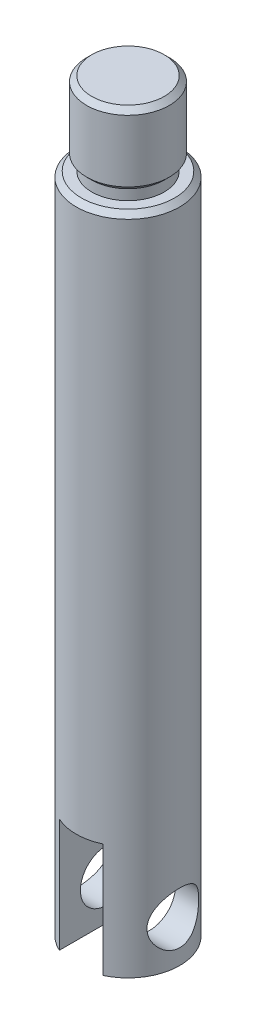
ISO-10303-21;
HEADER;
FILE_DESCRIPTION(('STEP AP214'),'2;1');
FILE_NAME('part.step','',(''),(''),'','','');
FILE_SCHEMA(('AUTOMOTIVE_DESIGN { 1 0 10303 214 1 1 1 1 }'));
ENDSEC;
DATA;
#1=APPLICATION_CONTEXT('core data for automotive mechanical design processes');
#2=APPLICATION_PROTOCOL_DEFINITION('international standard','automotive_design',2000,#1);
#3=PRODUCT_CONTEXT('',#1,'mechanical');
#4=PRODUCT('Part','Part','',(#3));
#5=PRODUCT_RELATED_PRODUCT_CATEGORY('part','',(#4));
#6=PRODUCT_DEFINITION_FORMATION('','',#4);
#7=PRODUCT_DEFINITION_CONTEXT('part definition',#1,'design');
#8=PRODUCT_DEFINITION('design','',#6,#7);
#9=PRODUCT_DEFINITION_SHAPE('','',#8);
#10=(LENGTH_UNIT() NAMED_UNIT(*) SI_UNIT(.MILLI.,.METRE.));
#11=(NAMED_UNIT(*) PLANE_ANGLE_UNIT() SI_UNIT($,.RADIAN.));
#12=(NAMED_UNIT(*) SI_UNIT($,.STERADIAN.) SOLID_ANGLE_UNIT());
#13=UNCERTAINTY_MEASURE_WITH_UNIT(LENGTH_MEASURE(1.E-05),#10,'distance_accuracy_value','');
#14=(GEOMETRIC_REPRESENTATION_CONTEXT(3) GLOBAL_UNCERTAINTY_ASSIGNED_CONTEXT((#13)) GLOBAL_UNIT_ASSIGNED_CONTEXT((#10,
#11,#12)) REPRESENTATION_CONTEXT('',''));
#15=CARTESIAN_POINT('',(0.,0.,0.));
#16=DIRECTION('',(0.,0.,1.));
#17=DIRECTION('',(1.,0.,0.));
#18=AXIS2_PLACEMENT_3D('',#15,#16,#17);
#19=CARTESIAN_POINT('',(0.,-32.5,0.));
#20=DIRECTION('',(0.,-1.,0.));
#21=DIRECTION('',(0.,0.,-1.));
#22=AXIS2_PLACEMENT_3D('',#19,#20,#21);
#23=PLANE('',#22);
#24=DIRECTION('',(0.,0.,-1.));
#25=VECTOR('',#24,1.);
#26=CARTESIAN_POINT('',(-1.05,-32.5,-2.5979873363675));
#27=LINE('',#26,#25);
#28=CARTESIAN_POINT('',(-1.05,-32.5,2.26881026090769));
#29=VERTEX_POINT('',#28);
#30=CARTESIAN_POINT('',(-1.05,-32.5,-2.26881026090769));
#31=VERTEX_POINT('',#30);
#32=EDGE_CURVE('E84',#29,#31,#27,.T.);
#33=ORIENTED_EDGE('',*,*,#32,.F.);
#34=CARTESIAN_POINT('',(0.,-32.5,0.));
#35=DIRECTION('',(0.,-1.,0.));
#36=DIRECTION('',(0.,0.,-1.));
#37=AXIS2_PLACEMENT_3D('',#34,#35,#36);
#38=CIRCLE('',#37,2.5);
#39=EDGE_CURVE('E97',#29,#31,#38,.T.);
#40=ORIENTED_EDGE('',*,*,#39,.T.);
#41=EDGE_LOOP('',(#33,#40));
#42=FACE_BOUND('',#41,.T.);
#43=ADVANCED_FACE('F35',(#42),#23,.T.);
#44=CARTESIAN_POINT('',(-4.25,-30.5,0.));
#45=DIRECTION('',(1.,0.,0.));
#46=DIRECTION('',(0.,0.,-1.));
#47=AXIS2_PLACEMENT_3D('',#44,#45,#46);
#48=CYLINDRICAL_SURFACE('',#47,1.25);
#49=CARTESIAN_POINT('',(-1.05,-30.5,0.));
#50=DIRECTION('',(-1.,0.,0.));
#51=DIRECTION('',(0.,0.,1.));
#52=AXIS2_PLACEMENT_3D('',#49,#50,#51);
#53=CIRCLE('',#52,1.25);
#54=CARTESIAN_POINT('',(-1.05,-30.5,1.25));
#55=VERTEX_POINT('',#54);
#56=EDGE_CURVE('E170',#55,#55,#53,.F.);
#57=ORIENTED_EDGE('',*,*,#56,.T.);
#58=EDGE_LOOP('',(#57));
#59=FACE_BOUND('',#58,.T.);
#60=CARTESIAN_POINT('',(-2.1650635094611,-30.5,-1.25));
#61=CARTESIAN_POINT('',(-2.16506918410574,-30.4348652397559,-1.24999545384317));
#62=CARTESIAN_POINT('',(-2.16804751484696,-30.3696482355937,-1.24487496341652));
#63=CARTESIAN_POINT('',(-2.17952958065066,-30.2412159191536,-1.22465401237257));
#64=CARTESIAN_POINT('',(-2.18804492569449,-30.1780051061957,-1.20953258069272));
#65=CARTESIAN_POINT('',(-2.20936683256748,-30.0556854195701,-1.17012493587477));
#66=CARTESIAN_POINT('',(-2.22215054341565,-29.996556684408,-1.14588744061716));
#67=CARTESIAN_POINT('',(-2.25053331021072,-29.8832197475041,-1.08908440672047));
#68=CARTESIAN_POINT('',(-2.26613251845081,-29.8290118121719,-1.05651841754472));
#69=CARTESIAN_POINT('',(-2.29996086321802,-29.7221178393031,-0.980833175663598));
#70=CARTESIAN_POINT('',(-2.31830079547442,-29.6699260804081,-0.937065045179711));
#71=CARTESIAN_POINT('',(-2.35464978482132,-29.5732395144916,-0.841567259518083));
#72=CARTESIAN_POINT('',(-2.37265867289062,-29.5287485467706,-0.789833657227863));
#73=CARTESIAN_POINT('',(-2.40776846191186,-29.4457910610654,-0.67561195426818));
#74=CARTESIAN_POINT('',(-2.42472633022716,-29.4079327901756,-0.612633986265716));
#75=CARTESIAN_POINT('',(-2.45438445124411,-29.3435739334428,-0.480196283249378));
#76=CARTESIAN_POINT('',(-2.46708738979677,-29.3170661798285,-0.410740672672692));
#77=CARTESIAN_POINT('',(-2.48600576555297,-29.2781191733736,-0.27255617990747));
#78=CARTESIAN_POINT('',(-2.49261850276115,-29.2648130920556,-0.20412723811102));
#79=CARTESIAN_POINT('',(-2.50009479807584,-29.2497923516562,-0.0657132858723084));
#80=CARTESIAN_POINT('',(-2.50096183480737,-29.2480706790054,0.00427075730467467));
#81=CARTESIAN_POINT('',(-2.49703727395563,-29.2559333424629,0.137290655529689));
#82=CARTESIAN_POINT('',(-2.492731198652,-29.2645475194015,0.200401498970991));
#83=CARTESIAN_POINT('',(-2.47967806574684,-29.2911010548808,0.324142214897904));
#84=CARTESIAN_POINT('',(-2.47093067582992,-29.3090411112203,0.384771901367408));
#85=CARTESIAN_POINT('',(-2.44964479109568,-29.3538532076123,0.502886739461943));
#86=CARTESIAN_POINT('',(-2.43705551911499,-29.3808453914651,0.560316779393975));
#87=CARTESIAN_POINT('',(-2.40922057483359,-29.4428292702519,0.669971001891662));
#88=CARTESIAN_POINT('',(-2.39397395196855,-29.4778238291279,0.722193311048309));
#89=CARTESIAN_POINT('',(-2.36055492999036,-29.5586191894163,0.825217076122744));
#90=CARTESIAN_POINT('',(-2.34224219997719,-29.6051287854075,0.8754175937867));
#91=CARTESIAN_POINT('',(-2.30567925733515,-29.7057371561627,0.967630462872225));
#92=CARTESIAN_POINT('',(-2.28742910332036,-29.7598417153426,1.00963651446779));
#93=CARTESIAN_POINT('',(-2.25180195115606,-29.8783102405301,1.08688166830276));
#94=CARTESIAN_POINT('',(-2.23455399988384,-29.9431075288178,1.12152164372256));
#95=CARTESIAN_POINT('',(-2.2046931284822,-30.0786720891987,1.17914889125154));
#96=CARTESIAN_POINT('',(-2.19207537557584,-30.149433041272,1.20214832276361));
#97=CARTESIAN_POINT('',(-2.17430794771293,-30.2890181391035,1.2339752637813));
#98=CARTESIAN_POINT('',(-2.1686456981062,-30.3575513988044,1.24378140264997));
#99=CARTESIAN_POINT('',(-2.16397399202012,-30.4955016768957,1.25189618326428));
#100=CARTESIAN_POINT('',(-2.16495983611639,-30.5649180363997,1.25021294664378));
#101=CARTESIAN_POINT('',(-2.17292920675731,-30.6945673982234,1.23629505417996));
#102=CARTESIAN_POINT('',(-2.17924484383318,-30.7549743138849,1.22523477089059));
#103=CARTESIAN_POINT('',(-2.19617526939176,-30.8729597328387,1.19462035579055));
#104=CARTESIAN_POINT('',(-2.20679145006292,-30.9305373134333,1.17506347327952));
#105=CARTESIAN_POINT('',(-2.23170277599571,-31.0442641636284,1.12705948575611));
#106=CARTESIAN_POINT('',(-2.24614554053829,-31.1002237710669,1.09824257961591));
#107=CARTESIAN_POINT('',(-2.27695149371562,-31.2068365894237,1.03285883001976));
#108=CARTESIAN_POINT('',(-2.29331566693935,-31.2574870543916,0.99628800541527));
#109=CARTESIAN_POINT('',(-2.3285999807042,-31.3587234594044,0.911046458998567));
#110=CARTESIAN_POINT('',(-2.34758228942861,-31.4084964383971,0.861431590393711));
#111=CARTESIAN_POINT('',(-2.38417793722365,-31.499265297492,0.754255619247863));
#112=CARTESIAN_POINT('',(-2.40179081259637,-31.5402582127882,0.696691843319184));
#113=CARTESIAN_POINT('',(-2.43426702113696,-31.6132171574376,0.573169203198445));
#114=CARTESIAN_POINT('',(-2.44904552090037,-31.6449163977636,0.507028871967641));
#115=CARTESIAN_POINT('',(-2.47354193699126,-31.6964223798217,0.369402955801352));
#116=CARTESIAN_POINT('',(-2.48326429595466,-31.7162395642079,0.297922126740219));
#117=CARTESIAN_POINT('',(-2.49584385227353,-31.7417107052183,0.15872460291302));
#118=CARTESIAN_POINT('',(-2.49924909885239,-31.7484973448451,0.0912643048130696));
#119=CARTESIAN_POINT('',(-2.50052662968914,-31.751054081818,-0.0439074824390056));
#120=CARTESIAN_POINT('',(-2.49840085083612,-31.7468280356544,-0.111618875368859));
#121=CARTESIAN_POINT('',(-2.48917461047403,-31.7282294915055,-0.240672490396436));
#122=CARTESIAN_POINT('',(-2.48241118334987,-31.7145439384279,-0.302140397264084));
#123=CARTESIAN_POINT('',(-2.46490117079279,-31.6783412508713,-0.421807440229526));
#124=CARTESIAN_POINT('',(-2.45415401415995,-31.6558228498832,-0.480006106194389));
#125=CARTESIAN_POINT('',(-2.4290741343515,-31.6015911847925,-0.594279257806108));
#126=CARTESIAN_POINT('',(-2.41460771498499,-31.5695258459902,-0.65015642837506));
#127=CARTESIAN_POINT('',(-2.38360166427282,-31.4975525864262,-0.755968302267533));
#128=CARTESIAN_POINT('',(-2.36706108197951,-31.4576410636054,-0.805900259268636));
#129=CARTESIAN_POINT('',(-2.33160762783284,-31.3665035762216,-0.903642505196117));
#130=CARTESIAN_POINT('',(-2.31262248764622,-31.3145468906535,-0.950747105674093));
#131=CARTESIAN_POINT('',(-2.27578845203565,-31.2031865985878,-1.03582910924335));
#132=CARTESIAN_POINT('',(-2.25794057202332,-31.1437764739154,-1.07379843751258));
#133=CARTESIAN_POINT('',(-2.22499506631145,-31.0167041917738,-1.14053884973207));
#134=CARTESIAN_POINT('',(-2.21000217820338,-30.9488405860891,-1.16898133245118));
#135=CARTESIAN_POINT('',(-2.18582695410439,-30.8083344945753,-1.21359838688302));
#136=CARTESIAN_POINT('',(-2.17662520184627,-30.7357088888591,-1.22981398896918));
#137=CARTESIAN_POINT('',(-2.16911590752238,-30.635243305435,-1.24295875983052));
#138=CARTESIAN_POINT('',(-2.1676016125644,-30.6082901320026,-1.24559513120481));
#139=CARTESIAN_POINT('',(-2.16557419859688,-30.5542293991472,-1.24911675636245));
#140=CARTESIAN_POINT('',(-2.16506114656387,-30.5271218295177,-1.25000189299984));
#141=CARTESIAN_POINT('',(-2.1650635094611,-30.5,-1.25));
#142=B_SPLINE_CURVE_WITH_KNOTS('',3,(#60,#61,#62,#63,#64,#65,#66,#67,#68,#69,#70,#71,#72,#73,
#74,#75,#76,#77,#78,#79,#80,#81,#82,#83,#84,#85,#86,#87,#88,#89,#90,#91,#92,#93,#94,#95,#96,#97,
#98,#99,#100,#101,#102,#103,#104,#105,#106,#107,#108,#109,#110,#111,#112,#113,#114,#115,#116,
#117,#118,#119,#120,#121,#122,#123,#124,#125,#126,#127,#128,#129,#130,#131,#132,#133,#134,#135,
#136,#137,#138,#139,#140,#141),.UNSPECIFIED.,.T.,.F.,(4,2,2,2,2,2,2,2,2,2,2,2,2,2,2,2,2,2,2,2,2,
2,2,2,2,2,2,2,2,2,2,2,2,2,2,2,2,2,2,2,4),(0.,0.195290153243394,0.390991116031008,
0.585660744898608,0.780340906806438,0.991077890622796,1.20191963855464,1.42697365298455,
1.65188533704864,1.86079356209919,2.0695752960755,2.26020121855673,2.45084140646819,
2.64411918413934,2.8374662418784,3.04908989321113,3.26087560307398,3.4861105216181,
3.71110967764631,3.91827863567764,4.12530116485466,4.30967729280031,4.49411315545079,
4.6870912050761,4.88016857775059,5.09758429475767,5.31507331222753,5.53830226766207,
5.76133474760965,5.96390337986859,6.16640108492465,6.35555531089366,6.54473666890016,
6.7420093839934,6.93937287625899,7.15637802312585,7.37357428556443,7.59763436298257,
7.82093916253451,7.90225168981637,7.98356965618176),.UNSPECIFIED.);
#143=CARTESIAN_POINT('',(-2.1650635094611,-30.5,-1.25));
#144=VERTEX_POINT('',#143);
#145=EDGE_CURVE('E103',#144,#144,#142,.T.);
#146=ORIENTED_EDGE('',*,*,#145,.F.);
#147=EDGE_LOOP('',(#146));
#148=FACE_BOUND('',#147,.T.);
#149=ADVANCED_FACE('F147',(#59,#148),#48,.F.);
#150=CARTESIAN_POINT('',(0.,3.5,0.));
#151=DIRECTION('',(0.,-1.,0.));
#152=DIRECTION('',(0.,0.,-1.));
#153=AXIS2_PLACEMENT_3D('',#150,#151,#152);
#154=CYLINDRICAL_SURFACE('',#153,2.);
#155=CARTESIAN_POINT('',(0.,0.25,0.));
#156=DIRECTION('',(0.,1.,0.));
#157=DIRECTION('',(0.,0.,1.));
#158=AXIS2_PLACEMENT_3D('',#155,#156,#157);
#159=CIRCLE('',#158,2.);
#160=CARTESIAN_POINT('',(0.,0.25,2.));
#161=VERTEX_POINT('',#160);
#162=EDGE_CURVE('E110',#161,#161,#159,.T.);
#163=ORIENTED_EDGE('',*,*,#162,.T.);
#164=EDGE_LOOP('',(#163));
#165=FACE_BOUND('',#164,.T.);
#166=CARTESIAN_POINT('',(0.,3.25,0.));
#167=DIRECTION('',(0.,1.,0.));
#168=DIRECTION('',(0.,0.,1.));
#169=AXIS2_PLACEMENT_3D('',#166,#167,#168);
#170=CIRCLE('',#169,2.);
#171=CARTESIAN_POINT('',(0.,3.25,2.));
#172=VERTEX_POINT('',#171);
#173=EDGE_CURVE('E100',#172,#172,#170,.F.);
#174=ORIENTED_EDGE('',*,*,#173,.T.);
#175=EDGE_LOOP('',(#174));
#176=FACE_BOUND('',#175,.T.);
#177=ADVANCED_FACE('F165',(#165,#176),#154,.T.);
#178=CARTESIAN_POINT('',(0.,3.5,0.));
#179=DIRECTION('',(0.,1.,0.));
#180=DIRECTION('',(0.,0.,1.));
#181=AXIS2_PLACEMENT_3D('',#178,#179,#180);
#182=PLANE('',#181);
#183=CARTESIAN_POINT('',(0.,3.5,0.));
#184=DIRECTION('',(0.,1.,0.));
#185=DIRECTION('',(0.,0.,1.));
#186=AXIS2_PLACEMENT_3D('',#183,#184,#185);
#187=CIRCLE('',#186,1.75);
#188=CARTESIAN_POINT('',(0.,3.5,1.75));
#189=VERTEX_POINT('',#188);
#190=EDGE_CURVE('E116',#189,#189,#187,.T.);
#191=ORIENTED_EDGE('',*,*,#190,.T.);
#192=EDGE_LOOP('',(#191));
#193=FACE_BOUND('',#192,.T.);
#194=ADVANCED_FACE('F210',(#193),#182,.T.);
#195=CARTESIAN_POINT('',(0.,0.25,0.));
#196=DIRECTION('',(0.,1.,0.));
#197=DIRECTION('',(0.,0.,1.));
#198=AXIS2_PLACEMENT_3D('',#195,#196,#197);
#199=CONICAL_SURFACE('',#198,2.,0.785398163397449);
#200=CARTESIAN_POINT('',(0.,0.,0.));
#201=DIRECTION('',(0.,1.,0.));
#202=DIRECTION('',(0.,0.,1.));
#203=AXIS2_PLACEMENT_3D('',#200,#201,#202);
#204=CIRCLE('',#203,1.75);
#205=CARTESIAN_POINT('',(0.,0.,1.75));
#206=VERTEX_POINT('',#205);
#207=EDGE_CURVE('E113',#206,#206,#204,.F.);
#208=ORIENTED_EDGE('',*,*,#207,.F.);
#209=EDGE_LOOP('',(#208));
#210=FACE_BOUND('',#209,.T.);
#211=ORIENTED_EDGE('',*,*,#162,.F.);
#212=EDGE_LOOP('',(#211));
#213=FACE_BOUND('',#212,.T.);
#214=ADVANCED_FACE('F205',(#210,#213),#199,.T.);
#215=CARTESIAN_POINT('',(0.,3.5,0.));
#216=DIRECTION('',(0.,-1.,0.));
#217=DIRECTION('',(0.,0.,-1.));
#218=AXIS2_PLACEMENT_3D('',#215,#216,#217);
#219=CONICAL_SURFACE('',#218,1.75,0.785398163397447);
#220=ORIENTED_EDGE('',*,*,#173,.F.);
#221=EDGE_LOOP('',(#220));
#222=FACE_BOUND('',#221,.T.);
#223=ORIENTED_EDGE('',*,*,#190,.F.);
#224=EDGE_LOOP('',(#223));
#225=FACE_BOUND('',#224,.T.);
#226=ADVANCED_FACE('F200',(#222,#225),#219,.T.);
#227=CARTESIAN_POINT('',(0.,-0.5,0.));
#228=DIRECTION('',(0.,1.,0.));
#229=DIRECTION('',(0.,0.,1.));
#230=AXIS2_PLACEMENT_3D('',#227,#228,#229);
#231=CYLINDRICAL_SURFACE('',#230,1.75);
#232=CARTESIAN_POINT('',(0.,-0.5,0.));
#233=DIRECTION('',(0.,-1.,0.));
#234=DIRECTION('',(0.,0.,-1.));
#235=AXIS2_PLACEMENT_3D('',#232,#233,#234);
#236=CIRCLE('',#235,1.75);
#237=CARTESIAN_POINT('',(0.,-0.5,-1.75));
#238=VERTEX_POINT('',#237);
#239=EDGE_CURVE('E96',#238,#238,#236,.T.);
#240=ORIENTED_EDGE('',*,*,#239,.F.);
#241=EDGE_LOOP('',(#240));
#242=FACE_BOUND('',#241,.T.);
#243=ORIENTED_EDGE('',*,*,#207,.T.);
#244=EDGE_LOOP('',(#243));
#245=FACE_BOUND('',#244,.T.);
#246=ADVANCED_FACE('F191',(#242,#245),#231,.T.);
#247=CARTESIAN_POINT('',(0.,-32.5,0.));
#248=DIRECTION('',(0.,1.,0.));
#249=DIRECTION('',(0.,0.,1.));
#250=AXIS2_PLACEMENT_3D('',#247,#248,#249);
#251=CYLINDRICAL_SURFACE('',#250,2.5);
#252=ORIENTED_EDGE('',*,*,#39,.F.);
#253=DIRECTION('',(0.,1.,0.));
#254=VECTOR('',#253,1.);
#255=CARTESIAN_POINT('',(-1.05,-32.5,2.26881026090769));
#256=LINE('',#255,#254);
#257=CARTESIAN_POINT('',(-1.05,-27.,2.26881026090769));
#258=VERTEX_POINT('',#257);
#259=EDGE_CURVE('E105',#29,#258,#256,.T.);
#260=ORIENTED_EDGE('',*,*,#259,.T.);
#261=CARTESIAN_POINT('',(0.,-27.,0.));
#262=DIRECTION('',(0.,-1.,0.));
#263=DIRECTION('',(0.,0.,-1.));
#264=AXIS2_PLACEMENT_3D('',#261,#262,#263);
#265=CIRCLE('',#264,2.5);
#266=CARTESIAN_POINT('',(1.05,-27.,2.26881026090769));
#267=VERTEX_POINT('',#266);
#268=EDGE_CURVE('E11',#267,#258,#265,.T.);
#269=ORIENTED_EDGE('',*,*,#268,.F.);
#270=DIRECTION('',(0.,1.,0.));
#271=VECTOR('',#270,1.);
#272=CARTESIAN_POINT('',(1.05,-32.5,2.26881026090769));
#273=LINE('',#272,#271);
#274=CARTESIAN_POINT('',(1.05,-32.5,2.26881026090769));
#275=VERTEX_POINT('',#274);
#276=EDGE_CURVE('E78',#267,#275,#273,.F.);
#277=ORIENTED_EDGE('',*,*,#276,.T.);
#278=CARTESIAN_POINT('',(1.05,-32.5,-2.26881026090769));
#279=VERTEX_POINT('',#278);
#280=EDGE_CURVE('E91',#279,#275,#38,.T.);
#281=ORIENTED_EDGE('',*,*,#280,.F.);
#282=DIRECTION('',(0.,1.,0.));
#283=VECTOR('',#282,1.);
#284=CARTESIAN_POINT('',(1.05,-32.5,-2.26881026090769));
#285=LINE('',#284,#283);
#286=CARTESIAN_POINT('',(1.05,-27.,-2.26881026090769));
#287=VERTEX_POINT('',#286);
#288=EDGE_CURVE('E51',#279,#287,#285,.T.);
#289=ORIENTED_EDGE('',*,*,#288,.T.);
#290=CARTESIAN_POINT('',(-1.05,-27.,-2.26881026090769));
#291=VERTEX_POINT('',#290);
#292=EDGE_CURVE('E40',#291,#287,#265,.T.);
#293=ORIENTED_EDGE('',*,*,#292,.F.);
#294=DIRECTION('',(0.,1.,0.));
#295=VECTOR('',#294,1.);
#296=CARTESIAN_POINT('',(-1.05,-32.5,-2.26881026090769));
#297=LINE('',#296,#295);
#298=EDGE_CURVE('E59',#291,#31,#297,.F.);
#299=ORIENTED_EDGE('',*,*,#298,.T.);
#300=EDGE_LOOP('',(#252,#260,#269,#277,#281,#289,#293,#299));
#301=FACE_BOUND('',#300,.T.);
#302=ORIENTED_EDGE('',*,*,#145,.T.);
#303=EDGE_LOOP('',(#302));
#304=FACE_BOUND('',#303,.T.);
#305=CARTESIAN_POINT('',(2.1650635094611,-30.5,-1.25));
#306=CARTESIAN_POINT('',(2.16506918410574,-30.5651347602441,-1.24999545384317));
#307=CARTESIAN_POINT('',(2.16804751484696,-30.6303517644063,-1.24487496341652));
#308=CARTESIAN_POINT('',(2.17952958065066,-30.7587840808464,-1.22465401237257));
#309=CARTESIAN_POINT('',(2.18804492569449,-30.8219948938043,-1.20953258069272));
#310=CARTESIAN_POINT('',(2.20936683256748,-30.9443145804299,-1.17012493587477));
#311=CARTESIAN_POINT('',(2.22215054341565,-31.003443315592,-1.14588744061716));
#312=CARTESIAN_POINT('',(2.25053331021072,-31.1167802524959,-1.08908440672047));
#313=CARTESIAN_POINT('',(2.26613251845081,-31.1709881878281,-1.05651841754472));
#314=CARTESIAN_POINT('',(2.29996086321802,-31.2778821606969,-0.980833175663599));
#315=CARTESIAN_POINT('',(2.31830079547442,-31.3300739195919,-0.937065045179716));
#316=CARTESIAN_POINT('',(2.35464978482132,-31.4267604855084,-0.841567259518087));
#317=CARTESIAN_POINT('',(2.37265867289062,-31.4712514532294,-0.789833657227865));
#318=CARTESIAN_POINT('',(2.40776846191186,-31.5542089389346,-0.675611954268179));
#319=CARTESIAN_POINT('',(2.42472633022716,-31.5920672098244,-0.612633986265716));
#320=CARTESIAN_POINT('',(2.45438445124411,-31.6564260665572,-0.480196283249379));
#321=CARTESIAN_POINT('',(2.46708738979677,-31.6829338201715,-0.410740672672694));
#322=CARTESIAN_POINT('',(2.48600576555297,-31.7218808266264,-0.272556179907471));
#323=CARTESIAN_POINT('',(2.49261850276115,-31.7351869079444,-0.204127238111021));
#324=CARTESIAN_POINT('',(2.50009479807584,-31.7502076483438,-0.065713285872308));
#325=CARTESIAN_POINT('',(2.50096183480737,-31.7519293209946,0.00427075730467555));
#326=CARTESIAN_POINT('',(2.49703727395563,-31.7440666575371,0.137290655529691));
#327=CARTESIAN_POINT('',(2.492731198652,-31.7354524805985,0.200401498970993));
#328=CARTESIAN_POINT('',(2.47967806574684,-31.7088989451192,0.324142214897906));
#329=CARTESIAN_POINT('',(2.47093067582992,-31.6909588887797,0.384771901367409));
#330=CARTESIAN_POINT('',(2.44964479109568,-31.6461467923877,0.502886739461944));
#331=CARTESIAN_POINT('',(2.43705551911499,-31.6191546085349,0.560316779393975));
#332=CARTESIAN_POINT('',(2.40922057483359,-31.5571707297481,0.669971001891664));
#333=CARTESIAN_POINT('',(2.39397395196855,-31.5221761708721,0.722193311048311));
#334=CARTESIAN_POINT('',(2.36055492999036,-31.4413808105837,0.825217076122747));
#335=CARTESIAN_POINT('',(2.34224219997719,-31.3948712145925,0.875417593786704));
#336=CARTESIAN_POINT('',(2.30567925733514,-31.2942628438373,0.967630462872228));
#337=CARTESIAN_POINT('',(2.28742910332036,-31.2401582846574,1.00963651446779));
#338=CARTESIAN_POINT('',(2.25180195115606,-31.1216897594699,1.08688166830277));
#339=CARTESIAN_POINT('',(2.23455399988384,-31.0568924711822,1.12152164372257));
#340=CARTESIAN_POINT('',(2.2046931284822,-30.9213279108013,1.17914889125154));
#341=CARTESIAN_POINT('',(2.19207537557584,-30.850566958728,1.20214832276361));
#342=CARTESIAN_POINT('',(2.17430794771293,-30.7109818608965,1.2339752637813));
#343=CARTESIAN_POINT('',(2.1686456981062,-30.6424486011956,1.24378140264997));
#344=CARTESIAN_POINT('',(2.16397399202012,-30.5044983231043,1.25189618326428));
#345=CARTESIAN_POINT('',(2.16495983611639,-30.4350819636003,1.25021294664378));
#346=CARTESIAN_POINT('',(2.17292920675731,-30.3054326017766,1.23629505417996));
#347=CARTESIAN_POINT('',(2.17924484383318,-30.2450256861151,1.22523477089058));
#348=CARTESIAN_POINT('',(2.19617526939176,-30.1270402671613,1.19462035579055));
#349=CARTESIAN_POINT('',(2.20679145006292,-30.0694626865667,1.17506347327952));
#350=CARTESIAN_POINT('',(2.23170277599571,-29.9557358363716,1.12705948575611));
#351=CARTESIAN_POINT('',(2.24614554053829,-29.8997762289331,1.0982425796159));
#352=CARTESIAN_POINT('',(2.27695149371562,-29.7931634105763,1.03285883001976));
#353=CARTESIAN_POINT('',(2.29331566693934,-29.7425129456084,0.99628800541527));
#354=CARTESIAN_POINT('',(2.3285999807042,-29.6412765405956,0.911046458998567));
#355=CARTESIAN_POINT('',(2.34758228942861,-29.5915035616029,0.861431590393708));
#356=CARTESIAN_POINT('',(2.38417793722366,-29.500734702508,0.754255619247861));
#357=CARTESIAN_POINT('',(2.40179081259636,-29.4597417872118,0.696691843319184));
#358=CARTESIAN_POINT('',(2.43426702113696,-29.3867828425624,0.573169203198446));
#359=CARTESIAN_POINT('',(2.44904552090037,-29.3550836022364,0.507028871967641));
#360=CARTESIAN_POINT('',(2.47354193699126,-29.3035776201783,0.369402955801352));
#361=CARTESIAN_POINT('',(2.48326429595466,-29.2837604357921,0.297922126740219));
#362=CARTESIAN_POINT('',(2.49584385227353,-29.2582892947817,0.158724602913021));
#363=CARTESIAN_POINT('',(2.49924909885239,-29.2515026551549,0.0912643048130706));
#364=CARTESIAN_POINT('',(2.50052662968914,-29.248945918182,-0.0439074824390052));
#365=CARTESIAN_POINT('',(2.49840085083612,-29.2531719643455,-0.111618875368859));
#366=CARTESIAN_POINT('',(2.48917461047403,-29.2717705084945,-0.240672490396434));
#367=CARTESIAN_POINT('',(2.48241118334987,-29.2854560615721,-0.302140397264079));
#368=CARTESIAN_POINT('',(2.46490117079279,-29.3216587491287,-0.421807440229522));
#369=CARTESIAN_POINT('',(2.45415401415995,-29.3441771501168,-0.480006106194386));
#370=CARTESIAN_POINT('',(2.4290741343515,-29.3984088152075,-0.594279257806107));
#371=CARTESIAN_POINT('',(2.41460771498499,-29.4304741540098,-0.650156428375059));
#372=CARTESIAN_POINT('',(2.38360166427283,-29.5024474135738,-0.755968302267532));
#373=CARTESIAN_POINT('',(2.36706108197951,-29.5423589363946,-0.805900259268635));
#374=CARTESIAN_POINT('',(2.33160762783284,-29.6334964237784,-0.903642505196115));
#375=CARTESIAN_POINT('',(2.31262248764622,-29.6854531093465,-0.950747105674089));
#376=CARTESIAN_POINT('',(2.27578845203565,-29.7968134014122,-1.03582910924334));
#377=CARTESIAN_POINT('',(2.25794057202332,-29.8562235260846,-1.07379843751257));
#378=CARTESIAN_POINT('',(2.22499506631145,-29.9832958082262,-1.14053884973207));
#379=CARTESIAN_POINT('',(2.21000217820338,-30.0511594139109,-1.16898133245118));
#380=CARTESIAN_POINT('',(2.18582695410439,-30.1916655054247,-1.21359838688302));
#381=CARTESIAN_POINT('',(2.17662520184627,-30.2642911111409,-1.22981398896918));
#382=CARTESIAN_POINT('',(2.16911590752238,-30.364756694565,-1.24295875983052));
#383=CARTESIAN_POINT('',(2.1676016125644,-30.3917098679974,-1.24559513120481));
#384=CARTESIAN_POINT('',(2.16557419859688,-30.4457706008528,-1.24911675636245));
#385=CARTESIAN_POINT('',(2.16506114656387,-30.4728781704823,-1.25000189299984));
#386=CARTESIAN_POINT('',(2.1650635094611,-30.5,-1.25));
#387=B_SPLINE_CURVE_WITH_KNOTS('',3,(#305,#306,#307,#308,#309,#310,#311,#312,#313,#314,#315,
#316,#317,#318,#319,#320,#321,#322,#323,#324,#325,#326,#327,#328,#329,#330,#331,#332,#333,#334,
#335,#336,#337,#338,#339,#340,#341,#342,#343,#344,#345,#346,#347,#348,#349,#350,#351,#352,#353,
#354,#355,#356,#357,#358,#359,#360,#361,#362,#363,#364,#365,#366,#367,#368,#369,#370,#371,#372,
#373,#374,#375,#376,#377,#378,#379,#380,#381,#382,#383,#384,#385,#386),.UNSPECIFIED.,.T.,.F.,(4,
2,2,2,2,2,2,2,2,2,2,2,2,2,2,2,2,2,2,2,2,2,2,2,2,2,2,2,2,2,2,2,2,2,2,2,2,2,2,2,4),(0.,
0.195290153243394,0.390991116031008,0.585660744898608,0.780340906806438,0.991077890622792,
1.20191963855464,1.42697365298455,1.65188533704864,1.86079356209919,2.0695752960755,
2.26020121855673,2.45084140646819,2.64411918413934,2.8374662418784,3.04908989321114,
3.26087560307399,3.48611052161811,3.71110967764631,3.91827863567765,4.12530116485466,
4.30967729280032,4.49411315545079,4.6870912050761,4.88016857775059,5.09758429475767,
5.31507331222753,5.53830226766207,5.76133474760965,5.96390337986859,6.16640108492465,
6.35555531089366,6.54473666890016,6.7420093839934,6.93937287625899,7.15637802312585,
7.37357428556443,7.59763436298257,7.82093916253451,7.90225168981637,7.98356965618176),.UNSPECIFIED.);
#388=CARTESIAN_POINT('',(2.1650635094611,-30.5,-1.25));
#389=VERTEX_POINT('',#388);
#390=EDGE_CURVE('E125',#389,#389,#387,.T.);
#391=ORIENTED_EDGE('',*,*,#390,.T.);
#392=EDGE_LOOP('',(#391));
#393=FACE_BOUND('',#392,.T.);
#394=CARTESIAN_POINT('',(0.,-0.750000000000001,0.));
#395=DIRECTION('',(0.,-1.,0.));
#396=DIRECTION('',(0.,0.,-1.));
#397=AXIS2_PLACEMENT_3D('',#394,#395,#396);
#398=CIRCLE('',#397,2.5);
#399=CARTESIAN_POINT('',(0.,-0.750000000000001,-2.5));
#400=VERTEX_POINT('',#399);
#401=EDGE_CURVE('E119',#400,#400,#398,.T.);
#402=ORIENTED_EDGE('',*,*,#401,.T.);
#403=EDGE_LOOP('',(#402));
#404=FACE_BOUND('',#403,.T.);
#405=ADVANCED_FACE('F89',(#301,#304,#393,#404),#251,.T.);
#406=DIRECTION('',(0.,0.,1.));
#407=VECTOR('',#406,1.);
#408=CARTESIAN_POINT('',(1.05,-32.5,-2.5979873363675));
#409=LINE('',#408,#407);
#410=EDGE_CURVE('E75',#279,#275,#409,.T.);
#411=ORIENTED_EDGE('',*,*,#410,.F.);
#412=ORIENTED_EDGE('',*,*,#280,.T.);
#413=EDGE_LOOP('',(#411,#412));
#414=FACE_BOUND('',#413,.T.);
#415=ADVANCED_FACE('F95',(#414),#23,.T.);
#416=CARTESIAN_POINT('',(0.,-0.5,0.));
#417=DIRECTION('',(0.,-1.,0.));
#418=DIRECTION('',(0.,0.,-1.));
#419=AXIS2_PLACEMENT_3D('',#416,#417,#418);
#420=PLANE('',#419);
#421=CARTESIAN_POINT('',(0.,-0.5,0.));
#422=DIRECTION('',(0.,-1.,0.));
#423=DIRECTION('',(0.,0.,-1.));
#424=AXIS2_PLACEMENT_3D('',#421,#422,#423);
#425=CIRCLE('',#424,2.24999999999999);
#426=CARTESIAN_POINT('',(0.,-0.5,-2.24999999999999));
#427=VERTEX_POINT('',#426);
#428=EDGE_CURVE('E122',#427,#427,#425,.F.);
#429=ORIENTED_EDGE('',*,*,#428,.T.);
#430=EDGE_LOOP('',(#429));
#431=FACE_BOUND('',#430,.T.);
#432=ORIENTED_EDGE('',*,*,#239,.T.);
#433=EDGE_LOOP('',(#432));
#434=FACE_BOUND('',#433,.T.);
#435=ADVANCED_FACE('F152',(#431,#434),#420,.F.);
#436=CARTESIAN_POINT('',(0.,-0.750000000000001,0.));
#437=DIRECTION('',(0.,-1.,0.));
#438=DIRECTION('',(0.,0.,-1.));
#439=AXIS2_PLACEMENT_3D('',#436,#437,#438);
#440=CONICAL_SURFACE('',#439,2.5,0.785398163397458);
#441=ORIENTED_EDGE('',*,*,#428,.F.);
#442=EDGE_LOOP('',(#441));
#443=FACE_BOUND('',#442,.T.);
#444=ORIENTED_EDGE('',*,*,#401,.F.);
#445=EDGE_LOOP('',(#444));
#446=FACE_BOUND('',#445,.T.);
#447=ADVANCED_FACE('F38',(#443,#446),#440,.T.);
#448=CARTESIAN_POINT('',(1.05,-30.5,0.));
#449=DIRECTION('',(1.,0.,0.));
#450=DIRECTION('',(0.,0.,-1.));
#451=AXIS2_PLACEMENT_3D('',#448,#449,#450);
#452=CIRCLE('',#451,1.25);
#453=CARTESIAN_POINT('',(1.05,-30.5,-1.25));
#454=VERTEX_POINT('',#453);
#455=EDGE_CURVE('E93',#454,#454,#452,.F.);
#456=ORIENTED_EDGE('',*,*,#455,.T.);
#457=EDGE_LOOP('',(#456));
#458=FACE_BOUND('',#457,.T.);
#459=ORIENTED_EDGE('',*,*,#390,.F.);
#460=EDGE_LOOP('',(#459));
#461=FACE_BOUND('',#460,.T.);
#462=ADVANCED_FACE('F140',(#458,#461),#48,.F.);
#463=CARTESIAN_POINT('',(0.,-27.,0.));
#464=DIRECTION('',(0.,-1.,0.));
#465=DIRECTION('',(0.,0.,-1.));
#466=AXIS2_PLACEMENT_3D('',#463,#464,#465);
#467=PLANE('',#466);
#468=ORIENTED_EDGE('',*,*,#268,.T.);
#469=DIRECTION('',(0.,0.,-1.));
#470=VECTOR('',#469,1.);
#471=CARTESIAN_POINT('',(-1.05,-27.,-2.5979873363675));
#472=LINE('',#471,#470);
#473=EDGE_CURVE('E83',#258,#291,#472,.T.);
#474=ORIENTED_EDGE('',*,*,#473,.T.);
#475=ORIENTED_EDGE('',*,*,#292,.T.);
#476=DIRECTION('',(0.,0.,1.));
#477=VECTOR('',#476,1.);
#478=CARTESIAN_POINT('',(1.05,-27.,-2.5979873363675));
#479=LINE('',#478,#477);
#480=EDGE_CURVE('E174',#287,#267,#479,.T.);
#481=ORIENTED_EDGE('',*,*,#480,.T.);
#482=EDGE_LOOP('',(#468,#474,#475,#481));
#483=FACE_BOUND('',#482,.T.);
#484=ADVANCED_FACE('F145',(#483),#467,.T.);
#485=CARTESIAN_POINT('',(-1.05,-27.,-2.5979873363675));
#486=DIRECTION('',(-1.,0.,0.));
#487=DIRECTION('',(0.,0.,1.));
#488=AXIS2_PLACEMENT_3D('',#485,#486,#487);
#489=PLANE('',#488);
#490=ORIENTED_EDGE('',*,*,#56,.F.);
#491=EDGE_LOOP('',(#490));
#492=FACE_BOUND('',#491,.T.);
#493=ORIENTED_EDGE('',*,*,#32,.T.);
#494=ORIENTED_EDGE('',*,*,#298,.F.);
#495=ORIENTED_EDGE('',*,*,#473,.F.);
#496=ORIENTED_EDGE('',*,*,#259,.F.);
#497=EDGE_LOOP('',(#493,#494,#495,#496));
#498=FACE_BOUND('',#497,.T.);
#499=ADVANCED_FACE('F148',(#492,#498),#489,.F.);
#500=CARTESIAN_POINT('',(1.05,-27.,-2.5979873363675));
#501=DIRECTION('',(1.,0.,0.));
#502=DIRECTION('',(0.,0.,-1.));
#503=AXIS2_PLACEMENT_3D('',#500,#501,#502);
#504=PLANE('',#503);
#505=ORIENTED_EDGE('',*,*,#455,.F.);
#506=EDGE_LOOP('',(#505));
#507=FACE_BOUND('',#506,.T.);
#508=ORIENTED_EDGE('',*,*,#410,.T.);
#509=ORIENTED_EDGE('',*,*,#276,.F.);
#510=ORIENTED_EDGE('',*,*,#480,.F.);
#511=ORIENTED_EDGE('',*,*,#288,.F.);
#512=EDGE_LOOP('',(#508,#509,#510,#511));
#513=FACE_BOUND('',#512,.T.);
#514=ADVANCED_FACE('F77',(#507,#513),#504,.F.);
#515=CLOSED_SHELL('',(#43,#149,#177,#194,#214,#226,#246,#405,#415,#435,#447,#462,#484,#499,#514));
#516=MANIFOLD_SOLID_BREP('B2',#515);
#517=ADVANCED_BREP_SHAPE_REPRESENTATION('',(#18,#516),#14);
#518=SHAPE_DEFINITION_REPRESENTATION(#9,#517);
ENDSEC;
END-ISO-10303-21;
